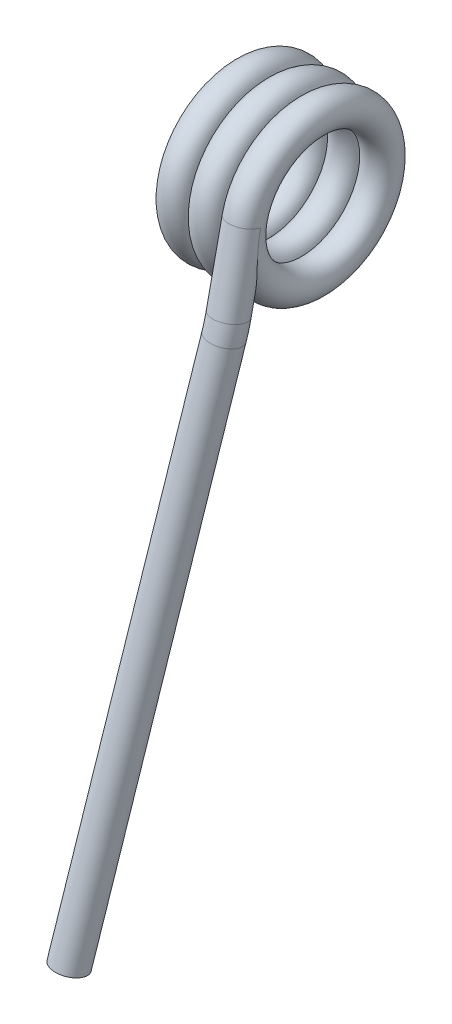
from build123d import *

# Parameters (mm, degrees)
SKETCH4_R = 0.75


with BuildPart() as part:
    # Sketch1 → Spring Coil_- Revolve1 (revolve)
    with BuildSketch(Plane.XY, mode=Mode.PRIVATE) as spring_coil_revolve1_sk:
        with BuildLine():
            Line((0.748638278, 3.295174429), (0.751361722, 3.295174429))
            ThreePointArc((0.751361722, 3.295174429), (1.5, 4), (2.248638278, 3.295174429))
            Line((2.248638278, 3.295174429), (2.251361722, 3.295174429))
            ThreePointArc((2.251361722, 3.295174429), (3.75, 3.25), (2.251361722, 3.204825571))
            Line((2.251361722, 3.204825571), (2.248638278, 3.204825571))
            ThreePointArc((2.248638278, 3.204825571), (1.5, 2.5), (0.751361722, 3.204825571))
            Line((0.751361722, 3.204825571), (0.748638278, 3.204825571))
            ThreePointArc((0.748638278, 3.204825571), (-0.75, 3.25), (0.748638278, 3.295174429))
        make_face()
    revolve(spring_coil_revolve1_sk.sketch.rotate(Axis((0, 0, 0), (-1, 0, 0)), 90), axis=Axis((0, 0, 0), (-1, 0, 0)))


with BuildPart() as body_2:
    # Torsion Leg- Sweep2: sweep along a path in Torsion Leg Sketch
    with BuildLine(Plane(origin=(3, 0.675712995, 3.178979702), x_dir=(-1, 0, 0), z_dir=(0, -0.20791169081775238, -0.9781476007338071))) as torsion_leg_sweep2_path:
        Line((0, 0), (0, -3.563390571))
        ThreePointArc((0, -3.563390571), (0.009517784, -3.999584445), (0.038053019, -4.434947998))
        Line((0.038053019, -4.434947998), (2.178893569, -28.904867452))
    # Sketch4 → Torsion Leg- Sweep2 (sweep)
    with BuildSketch(Plane(origin=(3, 0.675712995, 3.178979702), x_dir=(-1, 0, 0), z_dir=(0, -0.9781476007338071, 0.20791169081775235))):
        Circle(SKETCH4_R)
    sweep(path=torsion_leg_sweep2_path.line)

    # Merge Bodies: union part
    add(part.part)


solid = body_2.part
